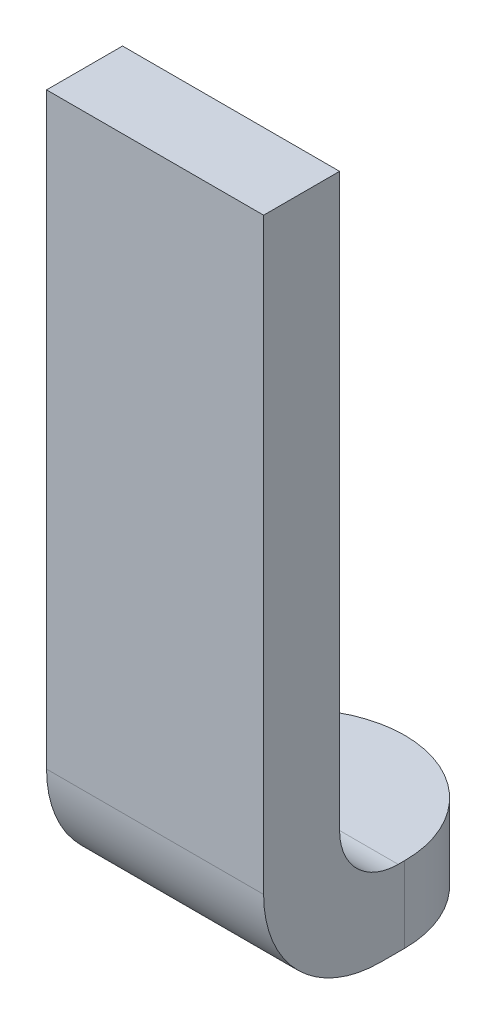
ISO-10303-21;
HEADER;
FILE_DESCRIPTION(('STEP AP214'),'2;1');
FILE_NAME('part.step','',(''),(''),'','','');
FILE_SCHEMA(('AUTOMOTIVE_DESIGN { 1 0 10303 214 1 1 1 1 }'));
ENDSEC;
DATA;
#1=APPLICATION_CONTEXT('core data for automotive mechanical design processes');
#2=APPLICATION_PROTOCOL_DEFINITION('international standard','automotive_design',2000,#1);
#3=PRODUCT_CONTEXT('',#1,'mechanical');
#4=PRODUCT('Part','Part','',(#3));
#5=PRODUCT_RELATED_PRODUCT_CATEGORY('part','',(#4));
#6=PRODUCT_DEFINITION_FORMATION('','',#4);
#7=PRODUCT_DEFINITION_CONTEXT('part definition',#1,'design');
#8=PRODUCT_DEFINITION('design','',#6,#7);
#9=PRODUCT_DEFINITION_SHAPE('','',#8);
#10=(LENGTH_UNIT() NAMED_UNIT(*) SI_UNIT(.MILLI.,.METRE.));
#11=(NAMED_UNIT(*) PLANE_ANGLE_UNIT() SI_UNIT($,.RADIAN.));
#12=(NAMED_UNIT(*) SI_UNIT($,.STERADIAN.) SOLID_ANGLE_UNIT());
#13=UNCERTAINTY_MEASURE_WITH_UNIT(LENGTH_MEASURE(1.E-05),#10,'distance_accuracy_value','');
#14=(GEOMETRIC_REPRESENTATION_CONTEXT(3) GLOBAL_UNCERTAINTY_ASSIGNED_CONTEXT((#13)) GLOBAL_UNIT_ASSIGNED_CONTEXT((#10,
#11,#12)) REPRESENTATION_CONTEXT('',''));
#15=CARTESIAN_POINT('',(0.,0.,0.));
#16=DIRECTION('',(0.,0.,1.));
#17=DIRECTION('',(1.,0.,0.));
#18=AXIS2_PLACEMENT_3D('',#15,#16,#17);
#19=CARTESIAN_POINT('',(0.5,3.15,-11.5));
#20=DIRECTION('',(0.,-1.,0.));
#21=DIRECTION('',(0.,0.,-1.));
#22=AXIS2_PLACEMENT_3D('',#19,#20,#21);
#23=PLANE('',#22);
#24=DIRECTION('',(0.,0.,1.));
#25=VECTOR('',#24,1.);
#26=CARTESIAN_POINT('',(-0.5,3.15,-11.5));
#27=LINE('',#26,#25);
#28=CARTESIAN_POINT('',(-0.5,3.15,-11.5));
#29=VERTEX_POINT('',#28);
#30=CARTESIAN_POINT('',(-0.5,3.15,-11.15));
#31=VERTEX_POINT('',#30);
#32=EDGE_CURVE('E10',#29,#31,#27,.T.);
#33=ORIENTED_EDGE('',*,*,#32,.T.);
#34=DIRECTION('',(-1.,0.,0.));
#35=VECTOR('',#34,1.);
#36=CARTESIAN_POINT('',(0.5,3.15,-11.15));
#37=LINE('',#36,#35);
#38=CARTESIAN_POINT('',(0.5,3.15,-11.15));
#39=VERTEX_POINT('',#38);
#40=EDGE_CURVE('E41',#39,#31,#37,.T.);
#41=ORIENTED_EDGE('',*,*,#40,.F.);
#42=DIRECTION('',(0.,0.,1.));
#43=VECTOR('',#42,1.);
#44=CARTESIAN_POINT('',(0.5,3.15,-11.5));
#45=LINE('',#44,#43);
#46=CARTESIAN_POINT('',(0.5,3.15,-11.5));
#47=VERTEX_POINT('',#46);
#48=EDGE_CURVE('E108',#47,#39,#45,.T.);
#49=ORIENTED_EDGE('',*,*,#48,.F.);
#50=DIRECTION('',(-1.,0.,0.));
#51=VECTOR('',#50,1.);
#52=CARTESIAN_POINT('',(0.5,3.15,-11.5));
#53=LINE('',#52,#51);
#54=EDGE_CURVE('E26',#47,#29,#53,.T.);
#55=ORIENTED_EDGE('',*,*,#54,.T.);
#56=EDGE_LOOP('',(#33,#41,#49,#55));
#57=FACE_BOUND('',#56,.T.);
#58=ADVANCED_FACE('F15',(#57),#23,.F.);
#59=CARTESIAN_POINT('',(0.5,3.15,-11.15));
#60=DIRECTION('',(0.,0.,-1.));
#61=DIRECTION('',(0.,-1.,0.));
#62=AXIS2_PLACEMENT_3D('',#59,#60,#61);
#63=PLANE('',#62);
#64=DIRECTION('',(0.,-1.,0.));
#65=VECTOR('',#64,1.);
#66=CARTESIAN_POINT('',(-0.5,3.15,-11.15));
#67=LINE('',#66,#65);
#68=CARTESIAN_POINT('',(-0.5,0.44,-11.15));
#69=VERTEX_POINT('',#68);
#70=EDGE_CURVE('E121',#31,#69,#67,.T.);
#71=ORIENTED_EDGE('',*,*,#70,.T.);
#72=DIRECTION('',(-1.,0.,0.));
#73=VECTOR('',#72,1.);
#74=CARTESIAN_POINT('',(0.5,0.44,-11.15));
#75=LINE('',#74,#73);
#76=CARTESIAN_POINT('',(0.5,0.44,-11.15));
#77=VERTEX_POINT('',#76);
#78=EDGE_CURVE('E142',#77,#69,#75,.T.);
#79=ORIENTED_EDGE('',*,*,#78,.F.);
#80=DIRECTION('',(0.,-1.,0.));
#81=VECTOR('',#80,1.);
#82=CARTESIAN_POINT('',(0.5,3.15,-11.15));
#83=LINE('',#82,#81);
#84=EDGE_CURVE('E19',#39,#77,#83,.T.);
#85=ORIENTED_EDGE('',*,*,#84,.F.);
#86=ORIENTED_EDGE('',*,*,#40,.T.);
#87=EDGE_LOOP('',(#71,#79,#85,#86));
#88=FACE_BOUND('',#87,.T.);
#89=ADVANCED_FACE('F193',(#88),#63,.F.);
#90=CARTESIAN_POINT('',(0.5,0.44,-11.69));
#91=DIRECTION('',(-1.,0.,0.));
#92=DIRECTION('',(0.,0.,1.));
#93=AXIS2_PLACEMENT_3D('',#90,#91,#92);
#94=CYLINDRICAL_SURFACE('',#93,0.54);
#95=CARTESIAN_POINT('',(-0.5,0.44,-11.69));
#96=DIRECTION('',(1.,0.,0.));
#97=DIRECTION('',(0.,0.,-1.));
#98=AXIS2_PLACEMENT_3D('',#95,#96,#97);
#99=CIRCLE('',#98,0.54);
#100=CARTESIAN_POINT('',(-0.5,-0.1,-11.69));
#101=VERTEX_POINT('',#100);
#102=EDGE_CURVE('E134',#69,#101,#99,.T.);
#103=ORIENTED_EDGE('',*,*,#102,.T.);
#104=DIRECTION('',(-1.,0.,0.));
#105=VECTOR('',#104,1.);
#106=CARTESIAN_POINT('',(0.5,-0.1,-11.69));
#107=LINE('',#106,#105);
#108=CARTESIAN_POINT('',(0.5,-0.1,-11.69));
#109=VERTEX_POINT('',#108);
#110=EDGE_CURVE('E170',#109,#101,#107,.T.);
#111=ORIENTED_EDGE('',*,*,#110,.F.);
#112=CARTESIAN_POINT('',(0.5,0.44,-11.69));
#113=DIRECTION('',(1.,0.,0.));
#114=DIRECTION('',(0.,0.,-1.));
#115=AXIS2_PLACEMENT_3D('',#112,#113,#114);
#116=CIRCLE('',#115,0.54);
#117=EDGE_CURVE('E160',#77,#109,#116,.T.);
#118=ORIENTED_EDGE('',*,*,#117,.F.);
#119=ORIENTED_EDGE('',*,*,#78,.T.);
#120=EDGE_LOOP('',(#103,#111,#118,#119));
#121=FACE_BOUND('',#120,.T.);
#122=ADVANCED_FACE('F201',(#121),#94,.T.);
#123=CARTESIAN_POINT('',(0.5,-0.1,-11.69));
#124=DIRECTION('',(0.,1.,0.));
#125=DIRECTION('',(1.,0.,0.));
#126=AXIS2_PLACEMENT_3D('',#123,#124,#125);
#127=PLANE('',#126);
#128=DIRECTION('',(0.,0.,-1.));
#129=VECTOR('',#128,1.);
#130=CARTESIAN_POINT('',(-0.5,-0.1,-11.69));
#131=LINE('',#130,#129);
#132=CARTESIAN_POINT('',(-0.5,-0.1,-11.8));
#133=VERTEX_POINT('',#132);
#134=EDGE_CURVE('E138',#101,#133,#131,.T.);
#135=ORIENTED_EDGE('',*,*,#134,.T.);
#136=CARTESIAN_POINT('',(0.,-0.1,-11.8));
#137=DIRECTION('',(0.,-1.,0.));
#138=DIRECTION('',(0.,0.,1.));
#139=AXIS2_PLACEMENT_3D('',#136,#137,#138);
#140=CIRCLE('',#139,0.5);
#141=CARTESIAN_POINT('',(0.5,-0.1,-11.8));
#142=VERTEX_POINT('',#141);
#143=EDGE_CURVE('E143',#133,#142,#140,.T.);
#144=ORIENTED_EDGE('',*,*,#143,.T.);
#145=DIRECTION('',(0.,0.,-1.));
#146=VECTOR('',#145,1.);
#147=CARTESIAN_POINT('',(0.5,-0.1,-11.69));
#148=LINE('',#147,#146);
#149=EDGE_CURVE('E137',#109,#142,#148,.T.);
#150=ORIENTED_EDGE('',*,*,#149,.F.);
#151=ORIENTED_EDGE('',*,*,#110,.T.);
#152=EDGE_LOOP('',(#135,#144,#150,#151));
#153=FACE_BOUND('',#152,.T.);
#154=ADVANCED_FACE('F319',(#153),#127,.F.);
#155=CARTESIAN_POINT('',(0.5,0.25,-12.3));
#156=DIRECTION('',(0.,-1.,0.));
#157=DIRECTION('',(0.,0.,-1.));
#158=AXIS2_PLACEMENT_3D('',#155,#156,#157);
#159=PLANE('',#158);
#160=CARTESIAN_POINT('',(0.,0.25,-11.8));
#161=DIRECTION('',(0.,1.,0.));
#162=DIRECTION('',(0.,0.,-1.));
#163=AXIS2_PLACEMENT_3D('',#160,#161,#162);
#164=CIRCLE('',#163,0.5);
#165=CARTESIAN_POINT('',(0.5,0.25,-11.8));
#166=VERTEX_POINT('',#165);
#167=CARTESIAN_POINT('',(-0.5,0.25,-11.8));
#168=VERTEX_POINT('',#167);
#169=EDGE_CURVE('E167',#166,#168,#164,.T.);
#170=ORIENTED_EDGE('',*,*,#169,.T.);
#171=DIRECTION('',(0.,0.,1.));
#172=VECTOR('',#171,1.);
#173=CARTESIAN_POINT('',(-0.5,0.25,-12.3));
#174=LINE('',#173,#172);
#175=CARTESIAN_POINT('',(-0.5,0.25,-11.77));
#176=VERTEX_POINT('',#175);
#177=EDGE_CURVE('E159',#168,#176,#174,.T.);
#178=ORIENTED_EDGE('',*,*,#177,.T.);
#179=DIRECTION('',(-1.,0.,0.));
#180=VECTOR('',#179,1.);
#181=CARTESIAN_POINT('',(0.5,0.25,-11.77));
#182=LINE('',#181,#180);
#183=CARTESIAN_POINT('',(0.5,0.25,-11.77));
#184=VERTEX_POINT('',#183);
#185=EDGE_CURVE('E144',#184,#176,#182,.T.);
#186=ORIENTED_EDGE('',*,*,#185,.F.);
#187=DIRECTION('',(0.,0.,1.));
#188=VECTOR('',#187,1.);
#189=CARTESIAN_POINT('',(0.5,0.25,-12.3));
#190=LINE('',#189,#188);
#191=EDGE_CURVE('E78',#166,#184,#190,.T.);
#192=ORIENTED_EDGE('',*,*,#191,.F.);
#193=EDGE_LOOP('',(#170,#178,#186,#192));
#194=FACE_BOUND('',#193,.T.);
#195=ADVANCED_FACE('F314',(#194),#159,.F.);
#196=CARTESIAN_POINT('',(0.5,0.52,-11.77));
#197=DIRECTION('',(-1.,0.,0.));
#198=DIRECTION('',(0.,0.,1.));
#199=AXIS2_PLACEMENT_3D('',#196,#197,#198);
#200=CYLINDRICAL_SURFACE('',#199,0.27);
#201=CARTESIAN_POINT('',(-0.5,0.52,-11.77));
#202=DIRECTION('',(-1.,0.,0.));
#203=DIRECTION('',(0.,0.,1.));
#204=AXIS2_PLACEMENT_3D('',#201,#202,#203);
#205=CIRCLE('',#204,0.27);
#206=CARTESIAN_POINT('',(-0.5,0.52,-11.5));
#207=VERTEX_POINT('',#206);
#208=EDGE_CURVE('E148',#176,#207,#205,.T.);
#209=ORIENTED_EDGE('',*,*,#208,.T.);
#210=DIRECTION('',(-1.,0.,0.));
#211=VECTOR('',#210,1.);
#212=CARTESIAN_POINT('',(0.5,0.52,-11.5));
#213=LINE('',#212,#211);
#214=CARTESIAN_POINT('',(0.5,0.52,-11.5));
#215=VERTEX_POINT('',#214);
#216=EDGE_CURVE('E92',#215,#207,#213,.T.);
#217=ORIENTED_EDGE('',*,*,#216,.F.);
#218=CARTESIAN_POINT('',(0.5,0.52,-11.77));
#219=DIRECTION('',(-1.,0.,0.));
#220=DIRECTION('',(0.,0.,1.));
#221=AXIS2_PLACEMENT_3D('',#218,#219,#220);
#222=CIRCLE('',#221,0.27);
#223=EDGE_CURVE('E124',#184,#215,#222,.T.);
#224=ORIENTED_EDGE('',*,*,#223,.F.);
#225=ORIENTED_EDGE('',*,*,#185,.T.);
#226=EDGE_LOOP('',(#209,#217,#224,#225));
#227=FACE_BOUND('',#226,.T.);
#228=ADVANCED_FACE('F318',(#227),#200,.F.);
#229=CARTESIAN_POINT('',(0.5,0.52,-11.5));
#230=DIRECTION('',(0.,0.,1.));
#231=DIRECTION('',(1.,0.,0.));
#232=AXIS2_PLACEMENT_3D('',#229,#230,#231);
#233=PLANE('',#232);
#234=DIRECTION('',(0.,1.,0.));
#235=VECTOR('',#234,1.);
#236=CARTESIAN_POINT('',(-0.5,0.52,-11.5));
#237=LINE('',#236,#235);
#238=EDGE_CURVE('E119',#207,#29,#237,.T.);
#239=ORIENTED_EDGE('',*,*,#238,.T.);
#240=ORIENTED_EDGE('',*,*,#54,.F.);
#241=DIRECTION('',(0.,1.,0.));
#242=VECTOR('',#241,1.);
#243=CARTESIAN_POINT('',(0.5,0.52,-11.5));
#244=LINE('',#243,#242);
#245=EDGE_CURVE('E115',#215,#47,#244,.T.);
#246=ORIENTED_EDGE('',*,*,#245,.F.);
#247=ORIENTED_EDGE('',*,*,#216,.T.);
#248=EDGE_LOOP('',(#239,#240,#246,#247));
#249=FACE_BOUND('',#248,.T.);
#250=ADVANCED_FACE('F117',(#249),#233,.F.);
#251=CARTESIAN_POINT('',(0.5,0.44,-11.69));
#252=DIRECTION('',(1.,0.,0.));
#253=DIRECTION('',(0.,1.,0.));
#254=AXIS2_PLACEMENT_3D('',#251,#252,#253);
#255=PLANE('',#254);
#256=ORIENTED_EDGE('',*,*,#149,.T.);
#257=DIRECTION('',(0.,1.,0.));
#258=VECTOR('',#257,1.);
#259=CARTESIAN_POINT('',(0.5,0.25,-11.8));
#260=LINE('',#259,#258);
#261=EDGE_CURVE('E151',#142,#166,#260,.T.);
#262=ORIENTED_EDGE('',*,*,#261,.T.);
#263=ORIENTED_EDGE('',*,*,#191,.T.);
#264=ORIENTED_EDGE('',*,*,#223,.T.);
#265=ORIENTED_EDGE('',*,*,#245,.T.);
#266=ORIENTED_EDGE('',*,*,#48,.T.);
#267=ORIENTED_EDGE('',*,*,#84,.T.);
#268=ORIENTED_EDGE('',*,*,#117,.T.);
#269=EDGE_LOOP('',(#256,#262,#263,#264,#265,#266,#267,#268));
#270=FACE_BOUND('',#269,.T.);
#271=ADVANCED_FACE('F17',(#270),#255,.T.);
#272=CARTESIAN_POINT('',(-0.5,0.44,-11.69));
#273=DIRECTION('',(1.,0.,0.));
#274=DIRECTION('',(0.,1.,0.));
#275=AXIS2_PLACEMENT_3D('',#272,#273,#274);
#276=PLANE('',#275);
#277=ORIENTED_EDGE('',*,*,#177,.F.);
#278=DIRECTION('',(0.,-1.,0.));
#279=VECTOR('',#278,1.);
#280=CARTESIAN_POINT('',(-0.5,0.44,-11.8));
#281=LINE('',#280,#279);
#282=EDGE_CURVE('E163',#168,#133,#281,.T.);
#283=ORIENTED_EDGE('',*,*,#282,.T.);
#284=ORIENTED_EDGE('',*,*,#134,.F.);
#285=ORIENTED_EDGE('',*,*,#102,.F.);
#286=ORIENTED_EDGE('',*,*,#70,.F.);
#287=ORIENTED_EDGE('',*,*,#32,.F.);
#288=ORIENTED_EDGE('',*,*,#238,.F.);
#289=ORIENTED_EDGE('',*,*,#208,.F.);
#290=EDGE_LOOP('',(#277,#283,#284,#285,#286,#287,#288,#289));
#291=FACE_BOUND('',#290,.T.);
#292=ADVANCED_FACE('F198',(#291),#276,.F.);
#293=CARTESIAN_POINT('',(0.,0.44,-11.8));
#294=DIRECTION('',(0.,-1.,0.));
#295=DIRECTION('',(0.,0.,-1.));
#296=AXIS2_PLACEMENT_3D('',#293,#294,#295);
#297=CYLINDRICAL_SURFACE('',#296,0.5);
#298=ORIENTED_EDGE('',*,*,#261,.F.);
#299=ORIENTED_EDGE('',*,*,#143,.F.);
#300=ORIENTED_EDGE('',*,*,#282,.F.);
#301=ORIENTED_EDGE('',*,*,#169,.F.);
#302=EDGE_LOOP('',(#298,#299,#300,#301));
#303=FACE_BOUND('',#302,.T.);
#304=ADVANCED_FACE('F371',(#303),#297,.T.);
#305=CLOSED_SHELL('',(#58,#89,#122,#154,#195,#228,#250,#271,#292,#304));
#306=MANIFOLD_SOLID_BREP('B1',#305);
#307=ADVANCED_BREP_SHAPE_REPRESENTATION('',(#18,#306),#14);
#308=SHAPE_DEFINITION_REPRESENTATION(#9,#307);
ENDSEC;
END-ISO-10303-21;
